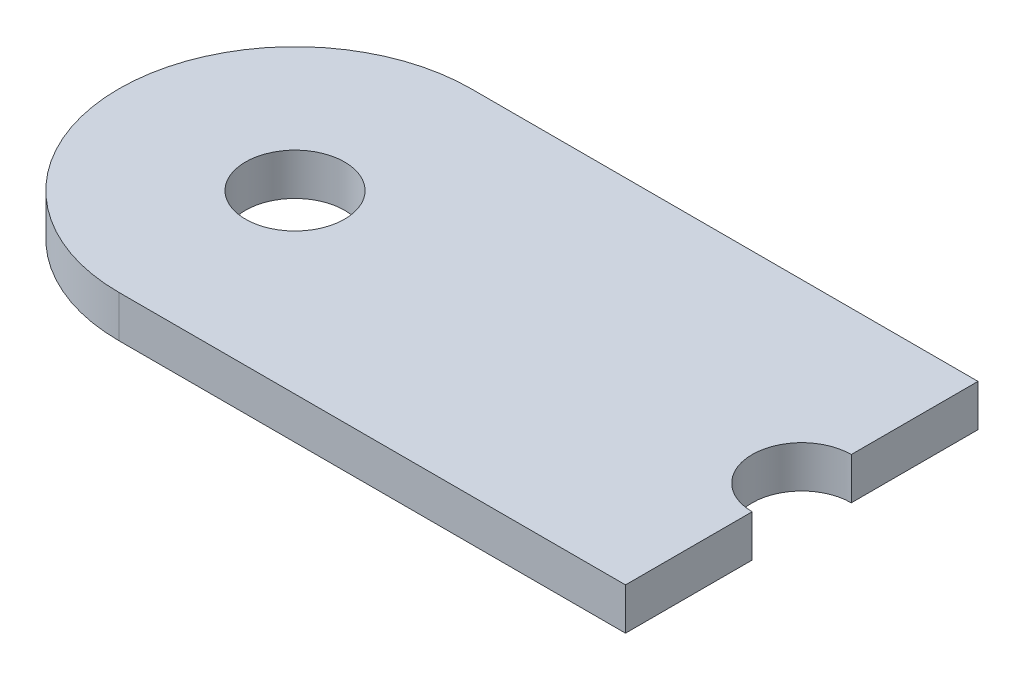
from build123d import *

# Parameters (mm, degrees)
SKETCH1_R           = 2.25
BOSS_EXTRUDE1_DEPTH = 0.95


with BuildPart() as part:
    # Sketch1 → Boss-Extrude1 (new, symmetric)
    with BuildSketch(Plane(origin=(0, 0, 0), x_dir=(1, 0, 0), z_dir=(0, 1, 0))):
        with BuildLine():
            Line((11.5, 8), (-11.5, 8))
            ThreePointArc((-11.5, 8), (-19.5, 0), (-11.5, -8))
            Line((-11.5, -8), (11.5, -8))
            Line((11.5, -8), (11.5, -2.25))
            ThreePointArc((11.5, -2.25), (9.25, 0), (11.5, 2.25))
            Line((11.5, 2.25), (11.5, 8))
        make_face()
        with Locations(Location((-11.5, 0, 0), (0, 0, 90))):
            Circle(SKETCH1_R, mode=Mode.SUBTRACT)
    extrude(amount=BOSS_EXTRUDE1_DEPTH, both=True)


solid = part.part
